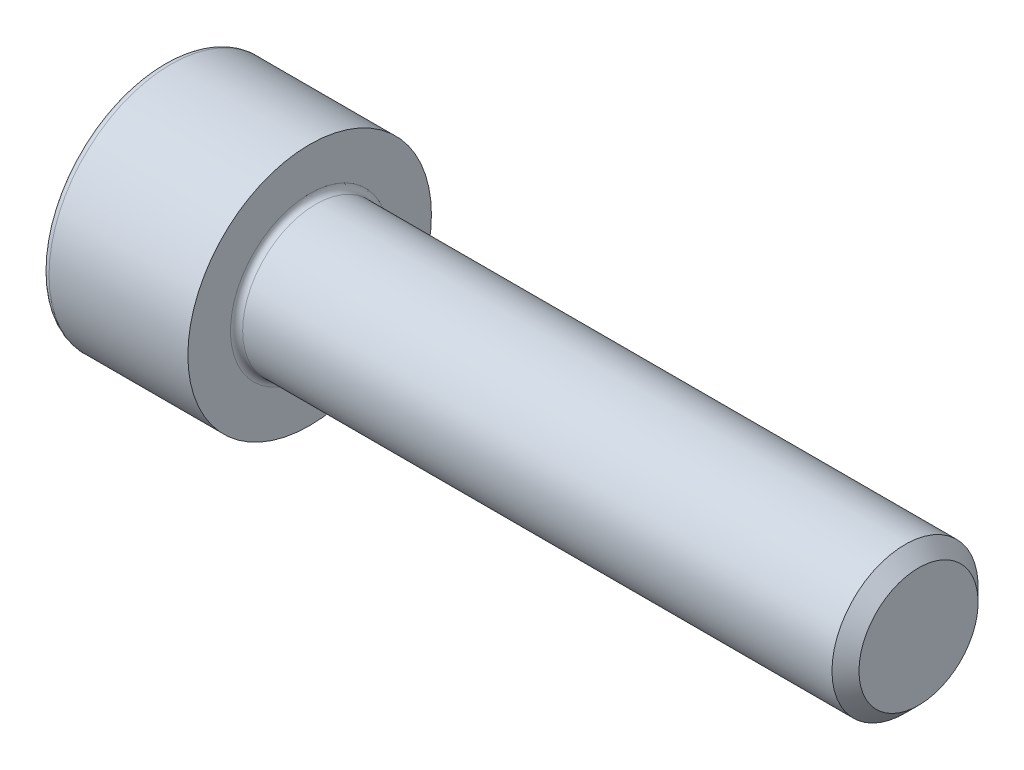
from build123d import *

# Parameters (mm, degrees)
FILLET1_R   = 0.25
FILLET2_R   = 0.3
HEX_2_DEPTH = 3


with BuildPart() as part:
    # BodySke → Base-Revolve (revolve)
    with BuildSketch(Plane.XY, mode=Mode.PRIVATE) as base_revolve_sk:
        Polygon((0, 0), (0, 5), (6, 5), (6, 3), (30.4455, 3), (31, 2.4455), (31, 0), align=None)
    revolve(base_revolve_sk.sketch.rotate(Axis((-31.75, 0, 0), (1, 0, 0)), 90), axis=Axis((-31.75, 0, 0), (1, 0, 0)))

    # Fillet1
    fillet1_edges = [part.edges().sort_by_distance(p)[0] for p in [
        (6, 0, -3),
    ]]
    fillet(fillet1_edges, radius=FILLET1_R)

    # Fillet2
    fillet2_edges = [part.edges().sort_by_distance(p)[0] for p in [
        (0, 0, -5),
    ]]
    fillet(fillet2_edges, radius=FILLET2_R)

    # Sketch2 → Hex-PreBroach (revolve, cut)
    with BuildSketch(Plane.XY, mode=Mode.PRIVATE) as hex_prebroach_sk:
        Polygon((0, 2.542), (3, 2.542), (4.467624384, 0), (0, 0), align=None)
    revolve(hex_prebroach_sk.sketch.rotate(Axis((0, 0, 0), (1, 0, 0)), 90), axis=Axis((0, 0, 0), (1, 0, 0)), mode=Mode.SUBTRACT)

    # Sketch3 → Hex 2 (cut)
    with BuildSketch(Plane(origin=(0, 0, 0), x_dir=(0, 0.500000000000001, 0.866025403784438), z_dir=(-1, 0, 0))):
        Polygon((1.467624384, 2.542), (-1.467624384, 2.542), (-2.935248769, 0), (-1.467624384, -2.542), (1.467624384, -2.542), (2.935248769, 0), align=None)
    extrude(amount=-HEX_2_DEPTH, mode=Mode.SUBTRACT)


solid = part.part
